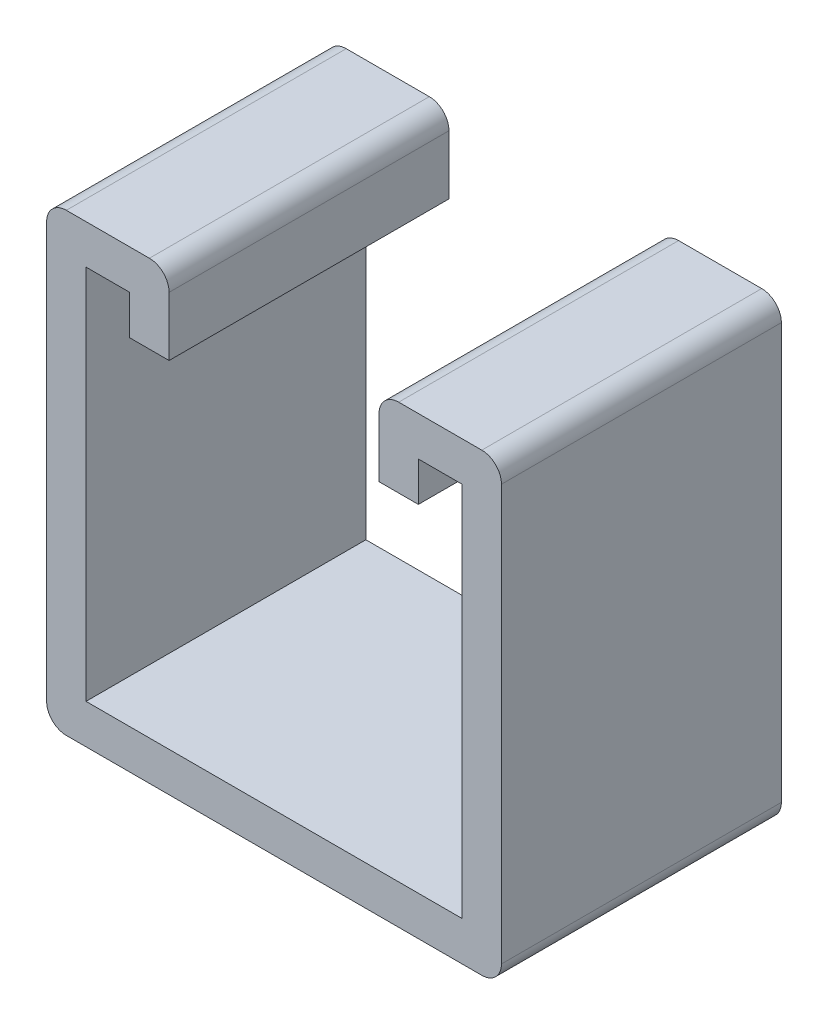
ISO-10303-21;
HEADER;
FILE_DESCRIPTION(('STEP AP214'),'2;1');
FILE_NAME('part.step','',(''),(''),'','','');
FILE_SCHEMA(('AUTOMOTIVE_DESIGN { 1 0 10303 214 1 1 1 1 }'));
ENDSEC;
DATA;
#1=APPLICATION_CONTEXT('core data for automotive mechanical design processes');
#2=APPLICATION_PROTOCOL_DEFINITION('international standard','automotive_design',2000,#1);
#3=PRODUCT_CONTEXT('',#1,'mechanical');
#4=PRODUCT('Part','Part','',(#3));
#5=PRODUCT_RELATED_PRODUCT_CATEGORY('part','',(#4));
#6=PRODUCT_DEFINITION_FORMATION('','',#4);
#7=PRODUCT_DEFINITION_CONTEXT('part definition',#1,'design');
#8=PRODUCT_DEFINITION('design','',#6,#7);
#9=PRODUCT_DEFINITION_SHAPE('','',#8);
#10=(LENGTH_UNIT() NAMED_UNIT(*) SI_UNIT(.MILLI.,.METRE.));
#11=(NAMED_UNIT(*) PLANE_ANGLE_UNIT() SI_UNIT($,.RADIAN.));
#12=(NAMED_UNIT(*) SI_UNIT($,.STERADIAN.) SOLID_ANGLE_UNIT());
#13=UNCERTAINTY_MEASURE_WITH_UNIT(LENGTH_MEASURE(1.E-05),#10,'distance_accuracy_value','');
#14=(GEOMETRIC_REPRESENTATION_CONTEXT(3) GLOBAL_UNCERTAINTY_ASSIGNED_CONTEXT((#13)) GLOBAL_UNIT_ASSIGNED_CONTEXT((#10,
#11,#12)) REPRESENTATION_CONTEXT('',''));
#15=CARTESIAN_POINT('',(0.,0.,0.));
#16=DIRECTION('',(0.,0.,1.));
#17=DIRECTION('',(1.,0.,0.));
#18=AXIS2_PLACEMENT_3D('',#15,#16,#17);
#19=CARTESIAN_POINT('',(9.525,13.49375,12.7));
#20=DIRECTION('',(0.,1.,0.));
#21=DIRECTION('',(0.,0.,1.));
#22=AXIS2_PLACEMENT_3D('',#19,#20,#21);
#23=PLANE('',#22);
#24=DIRECTION('',(1.,0.,0.));
#25=VECTOR('',#24,1.);
#26=CARTESIAN_POINT('',(9.525,13.49375,-12.7));
#27=LINE('',#26,#25);
#28=CARTESIAN_POINT('',(9.525,13.49375,-12.7));
#29=VERTEX_POINT('',#28);
#30=CARTESIAN_POINT('',(13.096875,13.49375,-12.7));
#31=VERTEX_POINT('',#30);
#32=EDGE_CURVE('E219',#29,#31,#27,.T.);
#33=ORIENTED_EDGE('',*,*,#32,.T.);
#34=DIRECTION('',(0.,0.,-1.));
#35=VECTOR('',#34,1.);
#36=CARTESIAN_POINT('',(13.096875,13.49375,12.7));
#37=LINE('',#36,#35);
#38=CARTESIAN_POINT('',(13.096875,13.49375,12.7));
#39=VERTEX_POINT('',#38);
#40=EDGE_CURVE('E11',#39,#31,#37,.T.);
#41=ORIENTED_EDGE('',*,*,#40,.F.);
#42=DIRECTION('',(1.,0.,0.));
#43=VECTOR('',#42,1.);
#44=CARTESIAN_POINT('',(9.525,13.49375,12.7));
#45=LINE('',#44,#43);
#46=CARTESIAN_POINT('',(9.525,13.49375,12.7));
#47=VERTEX_POINT('',#46);
#48=EDGE_CURVE('E261',#47,#39,#45,.T.);
#49=ORIENTED_EDGE('',*,*,#48,.F.);
#50=DIRECTION('',(0.,0.,-1.));
#51=VECTOR('',#50,1.);
#52=CARTESIAN_POINT('',(9.525,13.49375,12.7));
#53=LINE('',#52,#51);
#54=EDGE_CURVE('E215',#47,#29,#53,.T.);
#55=ORIENTED_EDGE('',*,*,#54,.T.);
#56=EDGE_LOOP('',(#33,#41,#49,#55));
#57=FACE_BOUND('',#56,.T.);
#58=ADVANCED_FACE('F39',(#57),#23,.F.);
#59=CARTESIAN_POINT('',(13.096875,17.065625,12.7));
#60=DIRECTION('',(-1.,0.,0.));
#61=DIRECTION('',(0.,0.,1.));
#62=AXIS2_PLACEMENT_3D('',#59,#60,#61);
#63=PLANE('',#62);
#64=DIRECTION('',(0.,1.,0.));
#65=VECTOR('',#64,1.);
#66=CARTESIAN_POINT('',(13.096875,17.065625,-12.7));
#67=LINE('',#66,#65);
#68=CARTESIAN_POINT('',(13.096875,17.065625,-12.7));
#69=VERTEX_POINT('',#68);
#70=EDGE_CURVE('E222',#31,#69,#67,.T.);
#71=ORIENTED_EDGE('',*,*,#70,.T.);
#72=DIRECTION('',(0.,0.,-1.));
#73=VECTOR('',#72,1.);
#74=CARTESIAN_POINT('',(13.096875,17.065625,12.7));
#75=LINE('',#74,#73);
#76=CARTESIAN_POINT('',(13.096875,17.065625,12.7));
#77=VERTEX_POINT('',#76);
#78=EDGE_CURVE('E47',#77,#69,#75,.T.);
#79=ORIENTED_EDGE('',*,*,#78,.F.);
#80=DIRECTION('',(0.,1.,0.));
#81=VECTOR('',#80,1.);
#82=CARTESIAN_POINT('',(13.096875,17.065625,12.7));
#83=LINE('',#82,#81);
#84=EDGE_CURVE('E140',#39,#77,#83,.T.);
#85=ORIENTED_EDGE('',*,*,#84,.F.);
#86=ORIENTED_EDGE('',*,*,#40,.T.);
#87=EDGE_LOOP('',(#71,#79,#85,#86));
#88=FACE_BOUND('',#87,.T.);
#89=ADVANCED_FACE('F389',(#88),#63,.F.);
#90=CARTESIAN_POINT('',(17.065625,17.065625,12.7));
#91=DIRECTION('',(0.,1.,0.));
#92=DIRECTION('',(0.,0.,1.));
#93=AXIS2_PLACEMENT_3D('',#90,#91,#92);
#94=PLANE('',#93);
#95=DIRECTION('',(1.,0.,0.));
#96=VECTOR('',#95,1.);
#97=CARTESIAN_POINT('',(17.065625,17.065625,-12.7));
#98=LINE('',#97,#96);
#99=CARTESIAN_POINT('',(17.065625,17.065625,-12.7));
#100=VERTEX_POINT('',#99);
#101=EDGE_CURVE('E224',#69,#100,#98,.T.);
#102=ORIENTED_EDGE('',*,*,#101,.T.);
#103=DIRECTION('',(0.,0.,-1.));
#104=VECTOR('',#103,1.);
#105=CARTESIAN_POINT('',(17.065625,17.065625,12.7));
#106=LINE('',#105,#104);
#107=CARTESIAN_POINT('',(17.065625,17.065625,12.7));
#108=VERTEX_POINT('',#107);
#109=EDGE_CURVE('E310',#108,#100,#106,.T.);
#110=ORIENTED_EDGE('',*,*,#109,.F.);
#111=DIRECTION('',(1.,0.,0.));
#112=VECTOR('',#111,1.);
#113=CARTESIAN_POINT('',(17.065625,17.065625,12.7));
#114=LINE('',#113,#112);
#115=EDGE_CURVE('E318',#77,#108,#114,.T.);
#116=ORIENTED_EDGE('',*,*,#115,.F.);
#117=ORIENTED_EDGE('',*,*,#78,.T.);
#118=EDGE_LOOP('',(#102,#110,#116,#117));
#119=FACE_BOUND('',#118,.T.);
#120=ADVANCED_FACE('F316',(#119),#94,.F.);
#121=CARTESIAN_POINT('',(17.065625,-17.065625,12.7));
#122=DIRECTION('',(1.,0.,0.));
#123=DIRECTION('',(0.,0.,-1.));
#124=AXIS2_PLACEMENT_3D('',#121,#122,#123);
#125=PLANE('',#124);
#126=DIRECTION('',(0.,-1.,0.));
#127=VECTOR('',#126,1.);
#128=CARTESIAN_POINT('',(17.065625,-17.065625,-12.7));
#129=LINE('',#128,#127);
#130=CARTESIAN_POINT('',(17.065625,-17.065625,-12.7));
#131=VERTEX_POINT('',#130);
#132=EDGE_CURVE('E226',#100,#131,#129,.T.);
#133=ORIENTED_EDGE('',*,*,#132,.T.);
#134=DIRECTION('',(0.,0.,-1.));
#135=VECTOR('',#134,1.);
#136=CARTESIAN_POINT('',(17.065625,-17.065625,12.7));
#137=LINE('',#136,#135);
#138=CARTESIAN_POINT('',(17.065625,-17.065625,12.7));
#139=VERTEX_POINT('',#138);
#140=EDGE_CURVE('E307',#139,#131,#137,.T.);
#141=ORIENTED_EDGE('',*,*,#140,.F.);
#142=DIRECTION('',(0.,-1.,0.));
#143=VECTOR('',#142,1.);
#144=CARTESIAN_POINT('',(17.065625,-17.065625,12.7));
#145=LINE('',#144,#143);
#146=EDGE_CURVE('E336',#108,#139,#145,.T.);
#147=ORIENTED_EDGE('',*,*,#146,.F.);
#148=ORIENTED_EDGE('',*,*,#109,.T.);
#149=EDGE_LOOP('',(#133,#141,#147,#148));
#150=FACE_BOUND('',#149,.T.);
#151=ADVANCED_FACE('F327',(#150),#125,.F.);
#152=CARTESIAN_POINT('',(-17.065625,-17.065625,12.7));
#153=DIRECTION('',(0.,-1.,0.));
#154=DIRECTION('',(0.,0.,-1.));
#155=AXIS2_PLACEMENT_3D('',#152,#153,#154);
#156=PLANE('',#155);
#157=DIRECTION('',(-1.,0.,0.));
#158=VECTOR('',#157,1.);
#159=CARTESIAN_POINT('',(-17.065625,-17.065625,-12.7));
#160=LINE('',#159,#158);
#161=CARTESIAN_POINT('',(-17.065625,-17.065625,-12.7));
#162=VERTEX_POINT('',#161);
#163=EDGE_CURVE('E228',#131,#162,#160,.T.);
#164=ORIENTED_EDGE('',*,*,#163,.T.);
#165=DIRECTION('',(0.,0.,-1.));
#166=VECTOR('',#165,1.);
#167=CARTESIAN_POINT('',(-17.065625,-17.065625,12.7));
#168=LINE('',#167,#166);
#169=CARTESIAN_POINT('',(-17.065625,-17.065625,12.7));
#170=VERTEX_POINT('',#169);
#171=EDGE_CURVE('E304',#170,#162,#168,.T.);
#172=ORIENTED_EDGE('',*,*,#171,.F.);
#173=DIRECTION('',(-1.,0.,0.));
#174=VECTOR('',#173,1.);
#175=CARTESIAN_POINT('',(-17.065625,-17.065625,12.7));
#176=LINE('',#175,#174);
#177=EDGE_CURVE('E333',#139,#170,#176,.T.);
#178=ORIENTED_EDGE('',*,*,#177,.F.);
#179=ORIENTED_EDGE('',*,*,#140,.T.);
#180=EDGE_LOOP('',(#164,#172,#178,#179));
#181=FACE_BOUND('',#180,.T.);
#182=ADVANCED_FACE('F331',(#181),#156,.F.);
#183=CARTESIAN_POINT('',(-17.065625,17.065625,12.7));
#184=DIRECTION('',(-1.,0.,0.));
#185=DIRECTION('',(0.,0.,1.));
#186=AXIS2_PLACEMENT_3D('',#183,#184,#185);
#187=PLANE('',#186);
#188=DIRECTION('',(0.,1.,0.));
#189=VECTOR('',#188,1.);
#190=CARTESIAN_POINT('',(-17.065625,17.065625,-12.7));
#191=LINE('',#190,#189);
#192=CARTESIAN_POINT('',(-17.065625,17.065625,-12.7));
#193=VERTEX_POINT('',#192);
#194=EDGE_CURVE('E230',#162,#193,#191,.T.);
#195=ORIENTED_EDGE('',*,*,#194,.T.);
#196=DIRECTION('',(0.,0.,-1.));
#197=VECTOR('',#196,1.);
#198=CARTESIAN_POINT('',(-17.065625,17.065625,12.7));
#199=LINE('',#198,#197);
#200=CARTESIAN_POINT('',(-17.065625,17.065625,12.7));
#201=VERTEX_POINT('',#200);
#202=EDGE_CURVE('E301',#201,#193,#199,.T.);
#203=ORIENTED_EDGE('',*,*,#202,.F.);
#204=DIRECTION('',(0.,1.,0.));
#205=VECTOR('',#204,1.);
#206=CARTESIAN_POINT('',(-17.065625,17.065625,12.7));
#207=LINE('',#206,#205);
#208=EDGE_CURVE('E335',#170,#201,#207,.T.);
#209=ORIENTED_EDGE('',*,*,#208,.F.);
#210=ORIENTED_EDGE('',*,*,#171,.T.);
#211=EDGE_LOOP('',(#195,#203,#209,#210));
#212=FACE_BOUND('',#211,.T.);
#213=ADVANCED_FACE('F402',(#212),#187,.F.);
#214=CARTESIAN_POINT('',(-13.096875,17.065625,12.7));
#215=DIRECTION('',(0.,1.,0.));
#216=DIRECTION('',(-1.,0.,0.));
#217=AXIS2_PLACEMENT_3D('',#214,#215,#216);
#218=PLANE('',#217);
#219=DIRECTION('',(1.,0.,0.));
#220=VECTOR('',#219,1.);
#221=CARTESIAN_POINT('',(-13.096875,17.065625,-12.7));
#222=LINE('',#221,#220);
#223=CARTESIAN_POINT('',(-13.096875,17.065625,-12.7));
#224=VERTEX_POINT('',#223);
#225=EDGE_CURVE('E232',#193,#224,#222,.T.);
#226=ORIENTED_EDGE('',*,*,#225,.T.);
#227=DIRECTION('',(0.,0.,-1.));
#228=VECTOR('',#227,1.);
#229=CARTESIAN_POINT('',(-13.096875,17.065625,12.7));
#230=LINE('',#229,#228);
#231=CARTESIAN_POINT('',(-13.096875,17.065625,12.7));
#232=VERTEX_POINT('',#231);
#233=EDGE_CURVE('E298',#232,#224,#230,.T.);
#234=ORIENTED_EDGE('',*,*,#233,.F.);
#235=DIRECTION('',(1.,0.,0.));
#236=VECTOR('',#235,1.);
#237=CARTESIAN_POINT('',(-13.096875,17.065625,12.7));
#238=LINE('',#237,#236);
#239=EDGE_CURVE('E338',#201,#232,#238,.T.);
#240=ORIENTED_EDGE('',*,*,#239,.F.);
#241=ORIENTED_EDGE('',*,*,#202,.T.);
#242=EDGE_LOOP('',(#226,#234,#240,#241));
#243=FACE_BOUND('',#242,.T.);
#244=ADVANCED_FACE('F405',(#243),#218,.F.);
#245=CARTESIAN_POINT('',(-13.096875,17.065625,12.7));
#246=DIRECTION('',(1.,0.,0.));
#247=DIRECTION('',(0.,0.,-1.));
#248=AXIS2_PLACEMENT_3D('',#245,#246,#247);
#249=PLANE('',#248);
#250=DIRECTION('',(0.,-1.,0.));
#251=VECTOR('',#250,1.);
#252=CARTESIAN_POINT('',(-13.096875,17.065625,-12.7));
#253=LINE('',#252,#251);
#254=CARTESIAN_POINT('',(-13.096875,13.49375,-12.7));
#255=VERTEX_POINT('',#254);
#256=EDGE_CURVE('E234',#224,#255,#253,.T.);
#257=ORIENTED_EDGE('',*,*,#256,.T.);
#258=DIRECTION('',(0.,0.,-1.));
#259=VECTOR('',#258,1.);
#260=CARTESIAN_POINT('',(-13.096875,13.49375,12.7));
#261=LINE('',#260,#259);
#262=CARTESIAN_POINT('',(-13.096875,13.49375,12.7));
#263=VERTEX_POINT('',#262);
#264=EDGE_CURVE('E295',#263,#255,#261,.T.);
#265=ORIENTED_EDGE('',*,*,#264,.F.);
#266=DIRECTION('',(0.,-1.,0.));
#267=VECTOR('',#266,1.);
#268=CARTESIAN_POINT('',(-13.096875,17.065625,12.7));
#269=LINE('',#268,#267);
#270=EDGE_CURVE('E344',#232,#263,#269,.T.);
#271=ORIENTED_EDGE('',*,*,#270,.F.);
#272=ORIENTED_EDGE('',*,*,#233,.T.);
#273=EDGE_LOOP('',(#257,#265,#271,#272));
#274=FACE_BOUND('',#273,.T.);
#275=ADVANCED_FACE('F409',(#274),#249,.F.);
#276=CARTESIAN_POINT('',(-13.096875,13.49375,12.7));
#277=DIRECTION('',(0.,1.,0.));
#278=DIRECTION('',(-1.,0.,0.));
#279=AXIS2_PLACEMENT_3D('',#276,#277,#278);
#280=PLANE('',#279);
#281=DIRECTION('',(1.,0.,0.));
#282=VECTOR('',#281,1.);
#283=CARTESIAN_POINT('',(-13.096875,13.49375,-12.7));
#284=LINE('',#283,#282);
#285=CARTESIAN_POINT('',(-9.525,13.49375,-12.7));
#286=VERTEX_POINT('',#285);
#287=EDGE_CURVE('E236',#255,#286,#284,.T.);
#288=ORIENTED_EDGE('',*,*,#287,.T.);
#289=DIRECTION('',(0.,0.,-1.));
#290=VECTOR('',#289,1.);
#291=CARTESIAN_POINT('',(-9.525,13.49375,12.7));
#292=LINE('',#291,#290);
#293=CARTESIAN_POINT('',(-9.525,13.49375,12.7));
#294=VERTEX_POINT('',#293);
#295=EDGE_CURVE('E292',#294,#286,#292,.T.);
#296=ORIENTED_EDGE('',*,*,#295,.F.);
#297=DIRECTION('',(1.,0.,0.));
#298=VECTOR('',#297,1.);
#299=CARTESIAN_POINT('',(-13.096875,13.49375,12.7));
#300=LINE('',#299,#298);
#301=EDGE_CURVE('E346',#263,#294,#300,.T.);
#302=ORIENTED_EDGE('',*,*,#301,.F.);
#303=ORIENTED_EDGE('',*,*,#264,.T.);
#304=EDGE_LOOP('',(#288,#296,#302,#303));
#305=FACE_BOUND('',#304,.T.);
#306=ADVANCED_FACE('F413',(#305),#280,.F.);
#307=CARTESIAN_POINT('',(-9.525,18.8515625,12.7));
#308=DIRECTION('',(-1.,0.,0.));
#309=DIRECTION('',(0.,-1.,0.));
#310=AXIS2_PLACEMENT_3D('',#307,#308,#309);
#311=PLANE('',#310);
#312=DIRECTION('',(0.,1.,0.));
#313=VECTOR('',#312,1.);
#314=CARTESIAN_POINT('',(-9.525,18.8515625,-12.7));
#315=LINE('',#314,#313);
#316=CARTESIAN_POINT('',(-9.525,18.8515625,-12.7));
#317=VERTEX_POINT('',#316);
#318=EDGE_CURVE('E238',#286,#317,#315,.T.);
#319=ORIENTED_EDGE('',*,*,#318,.T.);
#320=DIRECTION('',(0.,0.,-1.));
#321=VECTOR('',#320,1.);
#322=CARTESIAN_POINT('',(-9.525,18.8515625,12.7));
#323=LINE('',#322,#321);
#324=CARTESIAN_POINT('',(-9.525,18.8515625,12.7));
#325=VERTEX_POINT('',#324);
#326=EDGE_CURVE('E289',#325,#317,#323,.T.);
#327=ORIENTED_EDGE('',*,*,#326,.F.);
#328=DIRECTION('',(0.,1.,0.));
#329=VECTOR('',#328,1.);
#330=CARTESIAN_POINT('',(-9.525,18.8515625,12.7));
#331=LINE('',#330,#329);
#332=EDGE_CURVE('E348',#294,#325,#331,.T.);
#333=ORIENTED_EDGE('',*,*,#332,.F.);
#334=ORIENTED_EDGE('',*,*,#295,.T.);
#335=EDGE_LOOP('',(#319,#327,#333,#334));
#336=FACE_BOUND('',#335,.T.);
#337=ADVANCED_FACE('F417',(#336),#311,.F.);
#338=CARTESIAN_POINT('',(-11.3109375,18.8515625,12.7));
#339=DIRECTION('',(0.,0.,-1.));
#340=DIRECTION('',(-1.,0.,0.));
#341=AXIS2_PLACEMENT_3D('',#338,#339,#340);
#342=CYLINDRICAL_SURFACE('',#341,1.7859375);
#343=CARTESIAN_POINT('',(-11.3109375,18.8515625,-12.7));
#344=DIRECTION('',(0.,0.,1.));
#345=DIRECTION('',(-1.,0.,0.));
#346=AXIS2_PLACEMENT_3D('',#343,#344,#345);
#347=CIRCLE('',#346,1.7859375);
#348=CARTESIAN_POINT('',(-11.3109375,20.6375,-12.7));
#349=VERTEX_POINT('',#348);
#350=EDGE_CURVE('E240',#317,#349,#347,.T.);
#351=ORIENTED_EDGE('',*,*,#350,.T.);
#352=DIRECTION('',(0.,0.,-1.));
#353=VECTOR('',#352,1.);
#354=CARTESIAN_POINT('',(-11.3109375,20.6375,12.7));
#355=LINE('',#354,#353);
#356=CARTESIAN_POINT('',(-11.3109375,20.6375,12.7));
#357=VERTEX_POINT('',#356);
#358=EDGE_CURVE('E286',#357,#349,#355,.T.);
#359=ORIENTED_EDGE('',*,*,#358,.F.);
#360=CARTESIAN_POINT('',(-11.3109375,18.8515625,12.7));
#361=DIRECTION('',(0.,0.,1.));
#362=DIRECTION('',(-1.,0.,0.));
#363=AXIS2_PLACEMENT_3D('',#360,#361,#362);
#364=CIRCLE('',#363,1.7859375);
#365=EDGE_CURVE('E350',#325,#357,#364,.T.);
#366=ORIENTED_EDGE('',*,*,#365,.F.);
#367=ORIENTED_EDGE('',*,*,#326,.T.);
#368=EDGE_LOOP('',(#351,#359,#366,#367));
#369=FACE_BOUND('',#368,.T.);
#370=ADVANCED_FACE('F421',(#369),#342,.T.);
#371=CARTESIAN_POINT('',(-11.3109375,20.6375,12.7));
#372=DIRECTION('',(0.,-1.,0.));
#373=DIRECTION('',(1.,0.,0.));
#374=AXIS2_PLACEMENT_3D('',#371,#372,#373);
#375=PLANE('',#374);
#376=DIRECTION('',(-1.,0.,0.));
#377=VECTOR('',#376,1.);
#378=CARTESIAN_POINT('',(-11.3109375,20.6375,-12.7));
#379=LINE('',#378,#377);
#380=CARTESIAN_POINT('',(-18.8515625,20.6375,-12.7));
#381=VERTEX_POINT('',#380);
#382=EDGE_CURVE('E242',#349,#381,#379,.T.);
#383=ORIENTED_EDGE('',*,*,#382,.T.);
#384=DIRECTION('',(0.,0.,-1.));
#385=VECTOR('',#384,1.);
#386=CARTESIAN_POINT('',(-18.8515625,20.6375,12.7));
#387=LINE('',#386,#385);
#388=CARTESIAN_POINT('',(-18.8515625,20.6375,12.7));
#389=VERTEX_POINT('',#388);
#390=EDGE_CURVE('E283',#389,#381,#387,.T.);
#391=ORIENTED_EDGE('',*,*,#390,.F.);
#392=DIRECTION('',(-1.,0.,0.));
#393=VECTOR('',#392,1.);
#394=CARTESIAN_POINT('',(-11.3109375,20.6375,12.7));
#395=LINE('',#394,#393);
#396=EDGE_CURVE('E352',#357,#389,#395,.T.);
#397=ORIENTED_EDGE('',*,*,#396,.F.);
#398=ORIENTED_EDGE('',*,*,#358,.T.);
#399=EDGE_LOOP('',(#383,#391,#397,#398));
#400=FACE_BOUND('',#399,.T.);
#401=ADVANCED_FACE('F425',(#400),#375,.F.);
#402=CARTESIAN_POINT('',(-18.8515625,18.8515625,12.7));
#403=DIRECTION('',(0.,0.,-1.));
#404=DIRECTION('',(-1.,0.,0.));
#405=AXIS2_PLACEMENT_3D('',#402,#403,#404);
#406=CYLINDRICAL_SURFACE('',#405,1.7859375);
#407=CARTESIAN_POINT('',(-18.8515625,18.8515625,-12.7));
#408=DIRECTION('',(0.,0.,1.));
#409=DIRECTION('',(-1.,0.,0.));
#410=AXIS2_PLACEMENT_3D('',#407,#408,#409);
#411=CIRCLE('',#410,1.7859375);
#412=CARTESIAN_POINT('',(-20.6375,18.8515625,-12.7));
#413=VERTEX_POINT('',#412);
#414=EDGE_CURVE('E244',#381,#413,#411,.T.);
#415=ORIENTED_EDGE('',*,*,#414,.T.);
#416=DIRECTION('',(0.,0.,-1.));
#417=VECTOR('',#416,1.);
#418=CARTESIAN_POINT('',(-20.6375,18.8515625,12.7));
#419=LINE('',#418,#417);
#420=CARTESIAN_POINT('',(-20.6375,18.8515625,12.7));
#421=VERTEX_POINT('',#420);
#422=EDGE_CURVE('E280',#421,#413,#419,.T.);
#423=ORIENTED_EDGE('',*,*,#422,.F.);
#424=CARTESIAN_POINT('',(-18.8515625,18.8515625,12.7));
#425=DIRECTION('',(0.,0.,1.));
#426=DIRECTION('',(-1.,0.,0.));
#427=AXIS2_PLACEMENT_3D('',#424,#425,#426);
#428=CIRCLE('',#427,1.7859375);
#429=EDGE_CURVE('E354',#389,#421,#428,.T.);
#430=ORIENTED_EDGE('',*,*,#429,.F.);
#431=ORIENTED_EDGE('',*,*,#390,.T.);
#432=EDGE_LOOP('',(#415,#423,#430,#431));
#433=FACE_BOUND('',#432,.T.);
#434=ADVANCED_FACE('F429',(#433),#406,.T.);
#435=CARTESIAN_POINT('',(-20.6375,18.8515625,12.7));
#436=DIRECTION('',(1.,0.,0.));
#437=DIRECTION('',(0.,1.,0.));
#438=AXIS2_PLACEMENT_3D('',#435,#436,#437);
#439=PLANE('',#438);
#440=DIRECTION('',(0.,-1.,0.));
#441=VECTOR('',#440,1.);
#442=CARTESIAN_POINT('',(-20.6375,18.8515625,-12.7));
#443=LINE('',#442,#441);
#444=CARTESIAN_POINT('',(-20.6375,-18.8515625,-12.7));
#445=VERTEX_POINT('',#444);
#446=EDGE_CURVE('E246',#413,#445,#443,.T.);
#447=ORIENTED_EDGE('',*,*,#446,.T.);
#448=DIRECTION('',(0.,0.,-1.));
#449=VECTOR('',#448,1.);
#450=CARTESIAN_POINT('',(-20.6375,-18.8515625,12.7));
#451=LINE('',#450,#449);
#452=CARTESIAN_POINT('',(-20.6375,-18.8515625,12.7));
#453=VERTEX_POINT('',#452);
#454=EDGE_CURVE('E277',#453,#445,#451,.T.);
#455=ORIENTED_EDGE('',*,*,#454,.F.);
#456=DIRECTION('',(0.,-1.,0.));
#457=VECTOR('',#456,1.);
#458=CARTESIAN_POINT('',(-20.6375,18.8515625,12.7));
#459=LINE('',#458,#457);
#460=EDGE_CURVE('E356',#421,#453,#459,.T.);
#461=ORIENTED_EDGE('',*,*,#460,.F.);
#462=ORIENTED_EDGE('',*,*,#422,.T.);
#463=EDGE_LOOP('',(#447,#455,#461,#462));
#464=FACE_BOUND('',#463,.T.);
#465=ADVANCED_FACE('F433',(#464),#439,.F.);
#466=CARTESIAN_POINT('',(-18.8515625,-18.8515625,12.7));
#467=DIRECTION('',(0.,0.,-1.));
#468=DIRECTION('',(-1.,0.,0.));
#469=AXIS2_PLACEMENT_3D('',#466,#467,#468);
#470=CYLINDRICAL_SURFACE('',#469,1.7859375);
#471=CARTESIAN_POINT('',(-18.8515625,-18.8515625,-12.7));
#472=DIRECTION('',(0.,0.,1.));
#473=DIRECTION('',(-1.,0.,0.));
#474=AXIS2_PLACEMENT_3D('',#471,#472,#473);
#475=CIRCLE('',#474,1.7859375);
#476=CARTESIAN_POINT('',(-18.8515625,-20.6375,-12.7));
#477=VERTEX_POINT('',#476);
#478=EDGE_CURVE('E248',#445,#477,#475,.T.);
#479=ORIENTED_EDGE('',*,*,#478,.T.);
#480=DIRECTION('',(0.,0.,-1.));
#481=VECTOR('',#480,1.);
#482=CARTESIAN_POINT('',(-18.8515625,-20.6375,12.7));
#483=LINE('',#482,#481);
#484=CARTESIAN_POINT('',(-18.8515625,-20.6375,12.7));
#485=VERTEX_POINT('',#484);
#486=EDGE_CURVE('E274',#485,#477,#483,.T.);
#487=ORIENTED_EDGE('',*,*,#486,.F.);
#488=CARTESIAN_POINT('',(-18.8515625,-18.8515625,12.7));
#489=DIRECTION('',(0.,0.,1.));
#490=DIRECTION('',(-1.,0.,0.));
#491=AXIS2_PLACEMENT_3D('',#488,#489,#490);
#492=CIRCLE('',#491,1.7859375);
#493=EDGE_CURVE('E358',#453,#485,#492,.T.);
#494=ORIENTED_EDGE('',*,*,#493,.F.);
#495=ORIENTED_EDGE('',*,*,#454,.T.);
#496=EDGE_LOOP('',(#479,#487,#494,#495));
#497=FACE_BOUND('',#496,.T.);
#498=ADVANCED_FACE('F437',(#497),#470,.T.);
#499=CARTESIAN_POINT('',(-18.8515625,-20.6375,12.7));
#500=DIRECTION('',(0.,1.,0.));
#501=DIRECTION('',(-1.,0.,0.));
#502=AXIS2_PLACEMENT_3D('',#499,#500,#501);
#503=PLANE('',#502);
#504=DIRECTION('',(1.,0.,0.));
#505=VECTOR('',#504,1.);
#506=CARTESIAN_POINT('',(-18.8515625,-20.6375,-12.7));
#507=LINE('',#506,#505);
#508=CARTESIAN_POINT('',(18.8515625,-20.6375,-12.7));
#509=VERTEX_POINT('',#508);
#510=EDGE_CURVE('E250',#477,#509,#507,.T.);
#511=ORIENTED_EDGE('',*,*,#510,.T.);
#512=DIRECTION('',(0.,0.,-1.));
#513=VECTOR('',#512,1.);
#514=CARTESIAN_POINT('',(18.8515625,-20.6375,12.7));
#515=LINE('',#514,#513);
#516=CARTESIAN_POINT('',(18.8515625,-20.6375,12.7));
#517=VERTEX_POINT('',#516);
#518=EDGE_CURVE('E271',#517,#509,#515,.T.);
#519=ORIENTED_EDGE('',*,*,#518,.F.);
#520=DIRECTION('',(1.,0.,0.));
#521=VECTOR('',#520,1.);
#522=CARTESIAN_POINT('',(-18.8515625,-20.6375,12.7));
#523=LINE('',#522,#521);
#524=EDGE_CURVE('E360',#485,#517,#523,.T.);
#525=ORIENTED_EDGE('',*,*,#524,.F.);
#526=ORIENTED_EDGE('',*,*,#486,.T.);
#527=EDGE_LOOP('',(#511,#519,#525,#526));
#528=FACE_BOUND('',#527,.T.);
#529=ADVANCED_FACE('F441',(#528),#503,.F.);
#530=CARTESIAN_POINT('',(18.8515625,-18.8515625,12.7));
#531=DIRECTION('',(0.,0.,-1.));
#532=DIRECTION('',(-1.,0.,0.));
#533=AXIS2_PLACEMENT_3D('',#530,#531,#532);
#534=CYLINDRICAL_SURFACE('',#533,1.7859375);
#535=CARTESIAN_POINT('',(18.8515625,-18.8515625,-12.7));
#536=DIRECTION('',(0.,0.,1.));
#537=DIRECTION('',(-1.,0.,0.));
#538=AXIS2_PLACEMENT_3D('',#535,#536,#537);
#539=CIRCLE('',#538,1.7859375);
#540=CARTESIAN_POINT('',(20.6375,-18.8515625,-12.7));
#541=VERTEX_POINT('',#540);
#542=EDGE_CURVE('E252',#509,#541,#539,.T.);
#543=ORIENTED_EDGE('',*,*,#542,.T.);
#544=DIRECTION('',(0.,0.,-1.));
#545=VECTOR('',#544,1.);
#546=CARTESIAN_POINT('',(20.6375,-18.8515625,12.7));
#547=LINE('',#546,#545);
#548=CARTESIAN_POINT('',(20.6375,-18.8515625,12.7));
#549=VERTEX_POINT('',#548);
#550=EDGE_CURVE('E268',#549,#541,#547,.T.);
#551=ORIENTED_EDGE('',*,*,#550,.F.);
#552=CARTESIAN_POINT('',(18.8515625,-18.8515625,12.7));
#553=DIRECTION('',(0.,0.,1.));
#554=DIRECTION('',(-1.,0.,0.));
#555=AXIS2_PLACEMENT_3D('',#552,#553,#554);
#556=CIRCLE('',#555,1.7859375);
#557=EDGE_CURVE('E362',#517,#549,#556,.T.);
#558=ORIENTED_EDGE('',*,*,#557,.F.);
#559=ORIENTED_EDGE('',*,*,#518,.T.);
#560=EDGE_LOOP('',(#543,#551,#558,#559));
#561=FACE_BOUND('',#560,.T.);
#562=ADVANCED_FACE('F445',(#561),#534,.T.);
#563=CARTESIAN_POINT('',(20.6375,-18.8515625,12.7));
#564=DIRECTION('',(-1.,0.,0.));
#565=DIRECTION('',(0.,-1.,0.));
#566=AXIS2_PLACEMENT_3D('',#563,#564,#565);
#567=PLANE('',#566);
#568=DIRECTION('',(0.,1.,0.));
#569=VECTOR('',#568,1.);
#570=CARTESIAN_POINT('',(20.6375,-18.8515625,-12.7));
#571=LINE('',#570,#569);
#572=CARTESIAN_POINT('',(20.6375,18.8515625,-12.7));
#573=VERTEX_POINT('',#572);
#574=EDGE_CURVE('E254',#541,#573,#571,.T.);
#575=ORIENTED_EDGE('',*,*,#574,.T.);
#576=DIRECTION('',(0.,0.,-1.));
#577=VECTOR('',#576,1.);
#578=CARTESIAN_POINT('',(20.6375,18.8515625,12.7));
#579=LINE('',#578,#577);
#580=CARTESIAN_POINT('',(20.6375,18.8515625,12.7));
#581=VERTEX_POINT('',#580);
#582=EDGE_CURVE('E265',#581,#573,#579,.T.);
#583=ORIENTED_EDGE('',*,*,#582,.F.);
#584=DIRECTION('',(0.,1.,0.));
#585=VECTOR('',#584,1.);
#586=CARTESIAN_POINT('',(20.6375,-18.8515625,12.7));
#587=LINE('',#586,#585);
#588=EDGE_CURVE('E364',#549,#581,#587,.T.);
#589=ORIENTED_EDGE('',*,*,#588,.F.);
#590=ORIENTED_EDGE('',*,*,#550,.T.);
#591=EDGE_LOOP('',(#575,#583,#589,#590));
#592=FACE_BOUND('',#591,.T.);
#593=ADVANCED_FACE('F370',(#592),#567,.F.);
#594=CARTESIAN_POINT('',(18.8515625,18.8515625,12.7));
#595=DIRECTION('',(0.,0.,-1.));
#596=DIRECTION('',(-1.,0.,0.));
#597=AXIS2_PLACEMENT_3D('',#594,#595,#596);
#598=CYLINDRICAL_SURFACE('',#597,1.7859375);
#599=CARTESIAN_POINT('',(18.8515625,18.8515625,-12.7));
#600=DIRECTION('',(0.,0.,1.));
#601=DIRECTION('',(-1.,0.,0.));
#602=AXIS2_PLACEMENT_3D('',#599,#600,#601);
#603=CIRCLE('',#602,1.7859375);
#604=CARTESIAN_POINT('',(18.8515625,20.6375,-12.7));
#605=VERTEX_POINT('',#604);
#606=EDGE_CURVE('E256',#573,#605,#603,.T.);
#607=ORIENTED_EDGE('',*,*,#606,.T.);
#608=DIRECTION('',(0.,0.,-1.));
#609=VECTOR('',#608,1.);
#610=CARTESIAN_POINT('',(18.8515625,20.6375,12.7));
#611=LINE('',#610,#609);
#612=CARTESIAN_POINT('',(18.8515625,20.6375,12.7));
#613=VERTEX_POINT('',#612);
#614=EDGE_CURVE('E210',#613,#605,#611,.T.);
#615=ORIENTED_EDGE('',*,*,#614,.F.);
#616=CARTESIAN_POINT('',(18.8515625,18.8515625,12.7));
#617=DIRECTION('',(0.,0.,1.));
#618=DIRECTION('',(-1.,0.,0.));
#619=AXIS2_PLACEMENT_3D('',#616,#617,#618);
#620=CIRCLE('',#619,1.7859375);
#621=EDGE_CURVE('E201',#581,#613,#620,.T.);
#622=ORIENTED_EDGE('',*,*,#621,.F.);
#623=ORIENTED_EDGE('',*,*,#582,.T.);
#624=EDGE_LOOP('',(#607,#615,#622,#623));
#625=FACE_BOUND('',#624,.T.);
#626=ADVANCED_FACE('F374',(#625),#598,.T.);
#627=CARTESIAN_POINT('',(18.8515625,20.6375,12.7));
#628=DIRECTION('',(0.,-1.,0.));
#629=DIRECTION('',(0.,0.,-1.));
#630=AXIS2_PLACEMENT_3D('',#627,#628,#629);
#631=PLANE('',#630);
#632=DIRECTION('',(-1.,0.,0.));
#633=VECTOR('',#632,1.);
#634=CARTESIAN_POINT('',(18.8515625,20.6375,-12.7));
#635=LINE('',#634,#633);
#636=CARTESIAN_POINT('',(11.3109375,20.6375,-12.7));
#637=VERTEX_POINT('',#636);
#638=EDGE_CURVE('E209',#605,#637,#635,.T.);
#639=ORIENTED_EDGE('',*,*,#638,.T.);
#640=DIRECTION('',(0.,0.,-1.));
#641=VECTOR('',#640,1.);
#642=CARTESIAN_POINT('',(11.3109375,20.6375,12.7));
#643=LINE('',#642,#641);
#644=CARTESIAN_POINT('',(11.3109375,20.6375,12.7));
#645=VERTEX_POINT('',#644);
#646=EDGE_CURVE('E206',#645,#637,#643,.T.);
#647=ORIENTED_EDGE('',*,*,#646,.F.);
#648=DIRECTION('',(-1.,0.,0.));
#649=VECTOR('',#648,1.);
#650=CARTESIAN_POINT('',(18.8515625,20.6375,12.7));
#651=LINE('',#650,#649);
#652=EDGE_CURVE('E195',#613,#645,#651,.T.);
#653=ORIENTED_EDGE('',*,*,#652,.F.);
#654=ORIENTED_EDGE('',*,*,#614,.T.);
#655=EDGE_LOOP('',(#639,#647,#653,#654));
#656=FACE_BOUND('',#655,.T.);
#657=ADVANCED_FACE('F207',(#656),#631,.F.);
#658=CARTESIAN_POINT('',(11.3109375,18.8515625,12.7));
#659=DIRECTION('',(0.,0.,-1.));
#660=DIRECTION('',(-1.,0.,0.));
#661=AXIS2_PLACEMENT_3D('',#658,#659,#660);
#662=CYLINDRICAL_SURFACE('',#661,1.7859375);
#663=CARTESIAN_POINT('',(11.3109375,18.8515625,-12.7));
#664=DIRECTION('',(0.,0.,1.));
#665=DIRECTION('',(-1.,0.,0.));
#666=AXIS2_PLACEMENT_3D('',#663,#664,#665);
#667=CIRCLE('',#666,1.7859375);
#668=CARTESIAN_POINT('',(9.525,18.8515625,-12.7));
#669=VERTEX_POINT('',#668);
#670=EDGE_CURVE('E126',#637,#669,#667,.T.);
#671=ORIENTED_EDGE('',*,*,#670,.T.);
#672=DIRECTION('',(0.,0.,-1.));
#673=VECTOR('',#672,1.);
#674=CARTESIAN_POINT('',(9.525,18.8515625,12.7));
#675=LINE('',#674,#673);
#676=CARTESIAN_POINT('',(9.525,18.8515625,12.7));
#677=VERTEX_POINT('',#676);
#678=EDGE_CURVE('E211',#677,#669,#675,.T.);
#679=ORIENTED_EDGE('',*,*,#678,.F.);
#680=CARTESIAN_POINT('',(11.3109375,18.8515625,12.7));
#681=DIRECTION('',(0.,0.,1.));
#682=DIRECTION('',(-1.,0.,0.));
#683=AXIS2_PLACEMENT_3D('',#680,#681,#682);
#684=CIRCLE('',#683,1.7859375);
#685=EDGE_CURVE('E199',#645,#677,#684,.T.);
#686=ORIENTED_EDGE('',*,*,#685,.F.);
#687=ORIENTED_EDGE('',*,*,#646,.T.);
#688=EDGE_LOOP('',(#671,#679,#686,#687));
#689=FACE_BOUND('',#688,.T.);
#690=ADVANCED_FACE('F213',(#689),#662,.T.);
#691=CARTESIAN_POINT('',(9.525,18.8515625,12.7));
#692=DIRECTION('',(1.,0.,0.));
#693=DIRECTION('',(0.,1.,0.));
#694=AXIS2_PLACEMENT_3D('',#691,#692,#693);
#695=PLANE('',#694);
#696=DIRECTION('',(0.,-1.,0.));
#697=VECTOR('',#696,1.);
#698=CARTESIAN_POINT('',(9.525,18.8515625,-12.7));
#699=LINE('',#698,#697);
#700=EDGE_CURVE('E132',#669,#29,#699,.T.);
#701=ORIENTED_EDGE('',*,*,#700,.T.);
#702=ORIENTED_EDGE('',*,*,#54,.F.);
#703=DIRECTION('',(0.,-1.,0.));
#704=VECTOR('',#703,1.);
#705=CARTESIAN_POINT('',(9.525,18.8515625,12.7));
#706=LINE('',#705,#704);
#707=EDGE_CURVE('E55',#677,#47,#706,.T.);
#708=ORIENTED_EDGE('',*,*,#707,.F.);
#709=ORIENTED_EDGE('',*,*,#678,.T.);
#710=EDGE_LOOP('',(#701,#702,#708,#709));
#711=FACE_BOUND('',#710,.T.);
#712=ADVANCED_FACE('F378',(#711),#695,.F.);
#713=CARTESIAN_POINT('',(-11.3109375,18.8515625,12.7));
#714=DIRECTION('',(0.,0.,-1.));
#715=DIRECTION('',(-1.,0.,0.));
#716=AXIS2_PLACEMENT_3D('',#713,#714,#715);
#717=PLANE('',#716);
#718=ORIENTED_EDGE('',*,*,#48,.T.);
#719=ORIENTED_EDGE('',*,*,#84,.T.);
#720=ORIENTED_EDGE('',*,*,#115,.T.);
#721=ORIENTED_EDGE('',*,*,#146,.T.);
#722=ORIENTED_EDGE('',*,*,#177,.T.);
#723=ORIENTED_EDGE('',*,*,#208,.T.);
#724=ORIENTED_EDGE('',*,*,#239,.T.);
#725=ORIENTED_EDGE('',*,*,#270,.T.);
#726=ORIENTED_EDGE('',*,*,#301,.T.);
#727=ORIENTED_EDGE('',*,*,#332,.T.);
#728=ORIENTED_EDGE('',*,*,#365,.T.);
#729=ORIENTED_EDGE('',*,*,#396,.T.);
#730=ORIENTED_EDGE('',*,*,#429,.T.);
#731=ORIENTED_EDGE('',*,*,#460,.T.);
#732=ORIENTED_EDGE('',*,*,#493,.T.);
#733=ORIENTED_EDGE('',*,*,#524,.T.);
#734=ORIENTED_EDGE('',*,*,#557,.T.);
#735=ORIENTED_EDGE('',*,*,#588,.T.);
#736=ORIENTED_EDGE('',*,*,#621,.T.);
#737=ORIENTED_EDGE('',*,*,#652,.T.);
#738=ORIENTED_EDGE('',*,*,#685,.T.);
#739=ORIENTED_EDGE('',*,*,#707,.T.);
#740=EDGE_LOOP('',(#718,#719,#720,#721,#722,#723,#724,#725,#726,#727,#728,#729,#730,#731,#732,
#733,#734,#735,#736,#737,#738,#739));
#741=FACE_BOUND('',#740,.T.);
#742=ADVANCED_FACE('F197',(#741),#717,.F.);
#743=CARTESIAN_POINT('',(-11.3109375,18.8515625,-12.7));
#744=DIRECTION('',(0.,0.,-1.));
#745=DIRECTION('',(-1.,0.,0.));
#746=AXIS2_PLACEMENT_3D('',#743,#744,#745);
#747=PLANE('',#746);
#748=ORIENTED_EDGE('',*,*,#32,.F.);
#749=ORIENTED_EDGE('',*,*,#700,.F.);
#750=ORIENTED_EDGE('',*,*,#670,.F.);
#751=ORIENTED_EDGE('',*,*,#638,.F.);
#752=ORIENTED_EDGE('',*,*,#606,.F.);
#753=ORIENTED_EDGE('',*,*,#574,.F.);
#754=ORIENTED_EDGE('',*,*,#542,.F.);
#755=ORIENTED_EDGE('',*,*,#510,.F.);
#756=ORIENTED_EDGE('',*,*,#478,.F.);
#757=ORIENTED_EDGE('',*,*,#446,.F.);
#758=ORIENTED_EDGE('',*,*,#414,.F.);
#759=ORIENTED_EDGE('',*,*,#382,.F.);
#760=ORIENTED_EDGE('',*,*,#350,.F.);
#761=ORIENTED_EDGE('',*,*,#318,.F.);
#762=ORIENTED_EDGE('',*,*,#287,.F.);
#763=ORIENTED_EDGE('',*,*,#256,.F.);
#764=ORIENTED_EDGE('',*,*,#225,.F.);
#765=ORIENTED_EDGE('',*,*,#194,.F.);
#766=ORIENTED_EDGE('',*,*,#163,.F.);
#767=ORIENTED_EDGE('',*,*,#132,.F.);
#768=ORIENTED_EDGE('',*,*,#101,.F.);
#769=ORIENTED_EDGE('',*,*,#70,.F.);
#770=EDGE_LOOP('',(#748,#749,#750,#751,#752,#753,#754,#755,#756,#757,#758,#759,#760,#761,#762,
#763,#764,#765,#766,#767,#768,#769));
#771=FACE_BOUND('',#770,.T.);
#772=ADVANCED_FACE('F322',(#771),#747,.T.);
#773=CLOSED_SHELL('',(#58,#89,#120,#151,#182,#213,#244,#275,#306,#337,#370,#401,#434,#465,#498,
#529,#562,#593,#626,#657,#690,#712,#742,#772));
#774=MANIFOLD_SOLID_BREP('B2',#773);
#775=ADVANCED_BREP_SHAPE_REPRESENTATION('',(#18,#774),#14);
#776=SHAPE_DEFINITION_REPRESENTATION(#9,#775);
ENDSEC;
END-ISO-10303-21;
